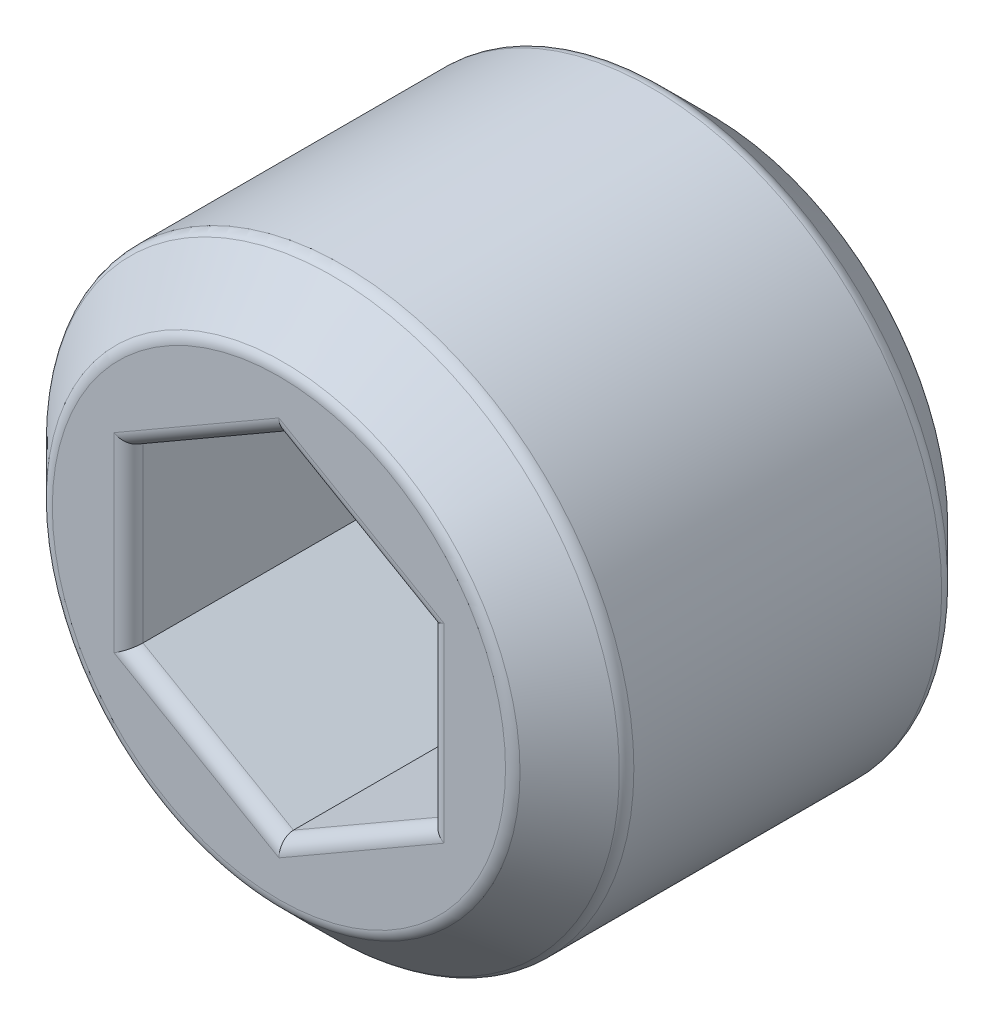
ISO-10303-21;
HEADER;
FILE_DESCRIPTION(('STEP AP214'),'2;1');
FILE_NAME('part.step','',(''),(''),'','','');
FILE_SCHEMA(('AUTOMOTIVE_DESIGN { 1 0 10303 214 1 1 1 1 }'));
ENDSEC;
DATA;
#1=APPLICATION_CONTEXT('core data for automotive mechanical design processes');
#2=APPLICATION_PROTOCOL_DEFINITION('international standard','automotive_design',2000,#1);
#3=PRODUCT_CONTEXT('',#1,'mechanical');
#4=PRODUCT('Part','Part','',(#3));
#5=PRODUCT_RELATED_PRODUCT_CATEGORY('part','',(#4));
#6=PRODUCT_DEFINITION_FORMATION('','',#4);
#7=PRODUCT_DEFINITION_CONTEXT('part definition',#1,'design');
#8=PRODUCT_DEFINITION('design','',#6,#7);
#9=PRODUCT_DEFINITION_SHAPE('','',#8);
#10=(LENGTH_UNIT() NAMED_UNIT(*) SI_UNIT(.MILLI.,.METRE.));
#11=(NAMED_UNIT(*) PLANE_ANGLE_UNIT() SI_UNIT($,.RADIAN.));
#12=(NAMED_UNIT(*) SI_UNIT($,.STERADIAN.) SOLID_ANGLE_UNIT());
#13=UNCERTAINTY_MEASURE_WITH_UNIT(LENGTH_MEASURE(1.E-05),#10,'distance_accuracy_value','');
#14=(GEOMETRIC_REPRESENTATION_CONTEXT(3) GLOBAL_UNCERTAINTY_ASSIGNED_CONTEXT((#13)) GLOBAL_UNIT_ASSIGNED_CONTEXT((#10,
#11,#12)) REPRESENTATION_CONTEXT('',''));
#15=CARTESIAN_POINT('',(0.,0.,0.));
#16=DIRECTION('',(0.,0.,1.));
#17=DIRECTION('',(1.,0.,0.));
#18=AXIS2_PLACEMENT_3D('',#15,#16,#17);
#19=CARTESIAN_POINT('',(0.,0.,3.));
#20=DIRECTION('',(0.,0.,-1.));
#21=DIRECTION('',(-1.,0.,0.));
#22=AXIS2_PLACEMENT_3D('',#19,#20,#21);
#23=CYLINDRICAL_SURFACE('',#22,2.);
#24=CARTESIAN_POINT('',(0.,0.,2.55857864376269));
#25=DIRECTION('',(0.,0.,1.));
#26=DIRECTION('',(1.,0.,0.));
#27=AXIS2_PLACEMENT_3D('',#24,#25,#26);
#28=CIRCLE('',#27,2.);
#29=CARTESIAN_POINT('',(2.,0.,2.55857864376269));
#30=VERTEX_POINT('',#29);
#31=EDGE_CURVE('E11',#30,#30,#28,.F.);
#32=ORIENTED_EDGE('',*,*,#31,.T.);
#33=EDGE_LOOP('',(#32));
#34=FACE_BOUND('',#33,.T.);
#35=CARTESIAN_POINT('',(0.,0.,0.44142135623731));
#36=DIRECTION('',(0.,0.,-1.));
#37=DIRECTION('',(-1.,0.,0.));
#38=AXIS2_PLACEMENT_3D('',#35,#36,#37);
#39=CIRCLE('',#38,2.);
#40=CARTESIAN_POINT('',(-2.,0.,0.44142135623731));
#41=VERTEX_POINT('',#40);
#42=EDGE_CURVE('E42',#41,#41,#39,.F.);
#43=ORIENTED_EDGE('',*,*,#42,.T.);
#44=EDGE_LOOP('',(#43));
#45=FACE_BOUND('',#44,.T.);
#46=ADVANCED_FACE('F35',(#34,#45),#23,.T.);
#47=CARTESIAN_POINT('',(0.,0.,3.));
#48=DIRECTION('',(0.,0.,1.));
#49=DIRECTION('',(1.,0.,0.));
#50=AXIS2_PLACEMENT_3D('',#47,#48,#49);
#51=PLANE('',#50);
#52=CARTESIAN_POINT('',(0.,0.,3.));
#53=DIRECTION('',(0.,0.,1.));
#54=DIRECTION('',(1.,0.,0.));
#55=AXIS2_PLACEMENT_3D('',#52,#53,#54);
#56=CIRCLE('',#55,1.55857864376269);
#57=CARTESIAN_POINT('',(1.55857864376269,0.,3.));
#58=VERTEX_POINT('',#57);
#59=EDGE_CURVE('E178',#58,#58,#56,.T.);
#60=ORIENTED_EDGE('',*,*,#59,.T.);
#61=EDGE_LOOP('',(#60));
#62=FACE_BOUND('',#61,.T.);
#63=DIRECTION('',(0.,-1.,0.));
#64=VECTOR('',#63,1.);
#65=CARTESIAN_POINT('',(-1.13481522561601,0.597450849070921,3.));
#66=LINE('',#65,#64);
#67=CARTESIAN_POINT('',(-1.134815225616,-0.655185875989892,3.));
#68=VERTEX_POINT('',#67);
#69=CARTESIAN_POINT('',(-1.13481522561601,0.655185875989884,3.));
#70=VERTEX_POINT('',#69);
#71=EDGE_CURVE('E173',#68,#70,#66,.F.);
#72=ORIENTED_EDGE('',*,*,#71,.T.);
#73=DIRECTION('',(-0.866025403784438,-0.500000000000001,0.));
#74=VECTOR('',#73,1.);
#75=CARTESIAN_POINT('',(-0.0500000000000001,1.28150423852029,3.));
#76=LINE('',#75,#74);
#77=CARTESIAN_POINT('',(0.,1.31037175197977,3.));
#78=VERTEX_POINT('',#77);
#79=EDGE_CURVE('E175',#70,#78,#76,.F.);
#80=ORIENTED_EDGE('',*,*,#79,.T.);
#81=DIRECTION('',(-0.866025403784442,0.499999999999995,0.));
#82=VECTOR('',#81,1.);
#83=CARTESIAN_POINT('',(1.084815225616,0.68405338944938,3.));
#84=LINE('',#83,#82);
#85=CARTESIAN_POINT('',(1.134815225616,0.655185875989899,3.));
#86=VERTEX_POINT('',#85);
#87=EDGE_CURVE('E165',#78,#86,#84,.F.);
#88=ORIENTED_EDGE('',*,*,#87,.T.);
#89=DIRECTION('',(0.,1.,0.));
#90=VECTOR('',#89,1.);
#91=CARTESIAN_POINT('',(1.13481522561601,-0.597450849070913,3.));
#92=LINE('',#91,#90);
#93=CARTESIAN_POINT('',(1.13481522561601,-0.655185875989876,3.));
#94=VERTEX_POINT('',#93);
#95=EDGE_CURVE('E167',#86,#94,#92,.F.);
#96=ORIENTED_EDGE('',*,*,#95,.T.);
#97=DIRECTION('',(0.866025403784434,0.500000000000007,0.));
#98=VECTOR('',#97,1.);
#99=CARTESIAN_POINT('',(0.0500000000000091,-1.28150423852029,3.));
#100=LINE('',#99,#98);
#101=CARTESIAN_POINT('',(0.,-1.31037175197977,3.));
#102=VERTEX_POINT('',#101);
#103=EDGE_CURVE('E169',#94,#102,#100,.F.);
#104=ORIENTED_EDGE('',*,*,#103,.T.);
#105=DIRECTION('',(0.866025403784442,-0.499999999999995,0.));
#106=VECTOR('',#105,1.);
#107=CARTESIAN_POINT('',(-1.084815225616,-0.684053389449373,3.));
#108=LINE('',#107,#106);
#109=EDGE_CURVE('E171',#102,#68,#108,.F.);
#110=ORIENTED_EDGE('',*,*,#109,.T.);
#111=EDGE_LOOP('',(#72,#80,#88,#96,#104,#110));
#112=FACE_BOUND('',#111,.T.);
#113=ADVANCED_FACE('F212',(#62,#112),#51,.T.);
#114=CARTESIAN_POINT('',(0.,0.,0.));
#115=DIRECTION('',(0.,0.,1.));
#116=DIRECTION('',(1.,0.,0.));
#117=AXIS2_PLACEMENT_3D('',#114,#115,#116);
#118=PLANE('',#117);
#119=CARTESIAN_POINT('',(0.,0.,0.));
#120=DIRECTION('',(0.,0.,1.));
#121=DIRECTION('',(1.,0.,0.));
#122=AXIS2_PLACEMENT_3D('',#119,#120,#121);
#123=CIRCLE('',#122,1.55857864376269);
#124=CARTESIAN_POINT('',(1.55857864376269,0.,0.));
#125=VERTEX_POINT('',#124);
#126=EDGE_CURVE('E148',#125,#125,#123,.F.);
#127=ORIENTED_EDGE('',*,*,#126,.T.);
#128=EDGE_LOOP('',(#127));
#129=FACE_BOUND('',#128,.T.);
#130=ADVANCED_FACE('F217',(#129),#118,.F.);
#131=CARTESIAN_POINT('',(0.,0.,0.4));
#132=DIRECTION('',(0.,0.,1.));
#133=DIRECTION('',(1.,0.,0.));
#134=AXIS2_PLACEMENT_3D('',#131,#132,#133);
#135=CONICAL_SURFACE('',#134,2.,0.78539816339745);
#136=CARTESIAN_POINT('',(0.,0.,0.029289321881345));
#137=DIRECTION('',(0.,0.,1.));
#138=DIRECTION('',(1.,0.,0.));
#139=AXIS2_PLACEMENT_3D('',#136,#137,#138);
#140=CIRCLE('',#139,1.62928932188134);
#141=CARTESIAN_POINT('',(1.62928932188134,0.,0.029289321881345));
#142=VERTEX_POINT('',#141);
#143=EDGE_CURVE('E162',#142,#142,#140,.T.);
#144=ORIENTED_EDGE('',*,*,#143,.T.);
#145=EDGE_LOOP('',(#144));
#146=FACE_BOUND('',#145,.T.);
#147=CARTESIAN_POINT('',(0.,0.,0.370710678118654));
#148=DIRECTION('',(0.,0.,1.));
#149=DIRECTION('',(1.,0.,0.));
#150=AXIS2_PLACEMENT_3D('',#147,#148,#149);
#151=CIRCLE('',#150,1.97071067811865);
#152=CARTESIAN_POINT('',(1.97071067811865,0.,0.370710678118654));
#153=VERTEX_POINT('',#152);
#154=EDGE_CURVE('E159',#153,#153,#151,.F.);
#155=ORIENTED_EDGE('',*,*,#154,.T.);
#156=EDGE_LOOP('',(#155));
#157=FACE_BOUND('',#156,.T.);
#158=ADVANCED_FACE('F224',(#146,#157),#135,.T.);
#159=CARTESIAN_POINT('',(0.,0.,3.));
#160=DIRECTION('',(0.,0.,-1.));
#161=DIRECTION('',(-1.,0.,0.));
#162=AXIS2_PLACEMENT_3D('',#159,#160,#161);
#163=CONICAL_SURFACE('',#162,1.6,0.785398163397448);
#164=CARTESIAN_POINT('',(0.,0.,2.97071067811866));
#165=DIRECTION('',(0.,0.,1.));
#166=DIRECTION('',(1.,0.,0.));
#167=AXIS2_PLACEMENT_3D('',#164,#165,#166);
#168=CIRCLE('',#167,1.62928932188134);
#169=CARTESIAN_POINT('',(1.62928932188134,0.,2.97071067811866));
#170=VERTEX_POINT('',#169);
#171=EDGE_CURVE('E184',#170,#170,#168,.F.);
#172=ORIENTED_EDGE('',*,*,#171,.T.);
#173=EDGE_LOOP('',(#172));
#174=FACE_BOUND('',#173,.T.);
#175=CARTESIAN_POINT('',(0.,0.,2.62928932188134));
#176=DIRECTION('',(0.,0.,-1.));
#177=DIRECTION('',(-1.,0.,0.));
#178=AXIS2_PLACEMENT_3D('',#175,#176,#177);
#179=CIRCLE('',#178,1.97071067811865);
#180=CARTESIAN_POINT('',(-1.97071067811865,0.,2.62928932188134));
#181=VERTEX_POINT('',#180);
#182=EDGE_CURVE('E181',#181,#181,#179,.F.);
#183=ORIENTED_EDGE('',*,*,#182,.T.);
#184=EDGE_LOOP('',(#183));
#185=FACE_BOUND('',#184,.T.);
#186=ADVANCED_FACE('F231',(#174,#185),#163,.T.);
#187=CARTESIAN_POINT('',(1.034815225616,0.597450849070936,1.));
#188=DIRECTION('',(0.499999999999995,0.866025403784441,0.));
#189=DIRECTION('',(-0.866025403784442,0.499999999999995,0.));
#190=AXIS2_PLACEMENT_3D('',#187,#188,#189);
#191=PLANE('',#190);
#192=DIRECTION('',(0.,0.,1.));
#193=VECTOR('',#192,1.);
#194=CARTESIAN_POINT('',(1.034815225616,0.597450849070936,1.));
#195=LINE('',#194,#193);
#196=CARTESIAN_POINT('',(1.034815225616,0.597450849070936,1.));
#197=VERTEX_POINT('',#196);
#198=CARTESIAN_POINT('',(1.034815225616,0.597450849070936,2.9));
#199=VERTEX_POINT('',#198);
#200=EDGE_CURVE('E146',#197,#199,#195,.T.);
#201=ORIENTED_EDGE('',*,*,#200,.T.);
#202=DIRECTION('',(-0.866025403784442,0.499999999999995,0.));
#203=VECTOR('',#202,1.);
#204=CARTESIAN_POINT('',(0.,1.19490169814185,2.9));
#205=LINE('',#204,#203);
#206=CARTESIAN_POINT('',(0.,1.19490169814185,2.9));
#207=VERTEX_POINT('',#206);
#208=EDGE_CURVE('E113',#199,#207,#205,.T.);
#209=ORIENTED_EDGE('',*,*,#208,.T.);
#210=DIRECTION('',(0.,0.,1.));
#211=VECTOR('',#210,1.);
#212=CARTESIAN_POINT('',(0.,1.19490169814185,1.));
#213=LINE('',#212,#211);
#214=CARTESIAN_POINT('',(0.,1.19490169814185,1.));
#215=VERTEX_POINT('',#214);
#216=EDGE_CURVE('E106',#215,#207,#213,.T.);
#217=ORIENTED_EDGE('',*,*,#216,.F.);
#218=DIRECTION('',(-0.866025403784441,0.499999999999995,0.));
#219=VECTOR('',#218,1.);
#220=CARTESIAN_POINT('',(1.034815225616,0.597450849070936,1.));
#221=LINE('',#220,#219);
#222=EDGE_CURVE('E110',#197,#215,#221,.T.);
#223=ORIENTED_EDGE('',*,*,#222,.F.);
#224=EDGE_LOOP('',(#201,#209,#217,#223));
#225=FACE_BOUND('',#224,.T.);
#226=ADVANCED_FACE('F108',(#225),#191,.F.);
#227=CARTESIAN_POINT('',(1.03481522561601,-0.597450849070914,1.));
#228=DIRECTION('',(1.,0.,0.));
#229=DIRECTION('',(0.,1.,0.));
#230=AXIS2_PLACEMENT_3D('',#227,#228,#229);
#231=PLANE('',#230);
#232=DIRECTION('',(0.,0.,1.));
#233=VECTOR('',#232,1.);
#234=CARTESIAN_POINT('',(1.03481522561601,-0.597450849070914,1.));
#235=LINE('',#234,#233);
#236=CARTESIAN_POINT('',(1.03481522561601,-0.597450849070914,1.));
#237=VERTEX_POINT('',#236);
#238=CARTESIAN_POINT('',(1.03481522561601,-0.597450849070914,2.9));
#239=VERTEX_POINT('',#238);
#240=EDGE_CURVE('E149',#237,#239,#235,.T.);
#241=ORIENTED_EDGE('',*,*,#240,.T.);
#242=DIRECTION('',(0.,1.,0.));
#243=VECTOR('',#242,1.);
#244=CARTESIAN_POINT('',(1.034815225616,0.597450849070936,2.9));
#245=LINE('',#244,#243);
#246=EDGE_CURVE('E49',#239,#199,#245,.T.);
#247=ORIENTED_EDGE('',*,*,#246,.T.);
#248=ORIENTED_EDGE('',*,*,#200,.F.);
#249=DIRECTION('',(0.,1.,0.));
#250=VECTOR('',#249,1.);
#251=CARTESIAN_POINT('',(1.03481522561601,-0.597450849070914,1.));
#252=LINE('',#251,#250);
#253=EDGE_CURVE('E118',#237,#197,#252,.T.);
#254=ORIENTED_EDGE('',*,*,#253,.F.);
#255=EDGE_LOOP('',(#241,#247,#248,#254));
#256=FACE_BOUND('',#255,.T.);
#257=ADVANCED_FACE('F238',(#256),#231,.F.);
#258=CARTESIAN_POINT('',(0.,-1.19490169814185,1.));
#259=DIRECTION('',(0.500000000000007,-0.866025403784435,0.));
#260=DIRECTION('',(0.866025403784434,0.500000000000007,0.));
#261=AXIS2_PLACEMENT_3D('',#258,#259,#260);
#262=PLANE('',#261);
#263=DIRECTION('',(0.,0.,1.));
#264=VECTOR('',#263,1.);
#265=CARTESIAN_POINT('',(0.,-1.19490169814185,1.));
#266=LINE('',#265,#264);
#267=CARTESIAN_POINT('',(0.,-1.19490169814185,1.));
#268=VERTEX_POINT('',#267);
#269=CARTESIAN_POINT('',(0.,-1.19490169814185,2.9));
#270=VERTEX_POINT('',#269);
#271=EDGE_CURVE('E151',#268,#270,#266,.T.);
#272=ORIENTED_EDGE('',*,*,#271,.T.);
#273=DIRECTION('',(0.866025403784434,0.500000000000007,0.));
#274=VECTOR('',#273,1.);
#275=CARTESIAN_POINT('',(1.03481522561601,-0.597450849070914,2.9));
#276=LINE('',#275,#274);
#277=EDGE_CURVE('E57',#270,#239,#276,.T.);
#278=ORIENTED_EDGE('',*,*,#277,.T.);
#279=ORIENTED_EDGE('',*,*,#240,.F.);
#280=DIRECTION('',(0.866025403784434,0.500000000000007,0.));
#281=VECTOR('',#280,1.);
#282=CARTESIAN_POINT('',(0.,-1.19490169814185,1.));
#283=LINE('',#282,#281);
#284=EDGE_CURVE('E143',#268,#237,#283,.T.);
#285=ORIENTED_EDGE('',*,*,#284,.F.);
#286=EDGE_LOOP('',(#272,#278,#279,#285));
#287=FACE_BOUND('',#286,.T.);
#288=ADVANCED_FACE('F248',(#287),#262,.F.);
#289=CARTESIAN_POINT('',(-1.034815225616,-0.597450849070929,1.));
#290=DIRECTION('',(-0.499999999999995,-0.866025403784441,0.));
#291=DIRECTION('',(0.866025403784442,-0.499999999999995,0.));
#292=AXIS2_PLACEMENT_3D('',#289,#290,#291);
#293=PLANE('',#292);
#294=DIRECTION('',(0.,0.,1.));
#295=VECTOR('',#294,1.);
#296=CARTESIAN_POINT('',(-1.034815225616,-0.597450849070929,1.));
#297=LINE('',#296,#295);
#298=CARTESIAN_POINT('',(-1.034815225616,-0.597450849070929,1.));
#299=VERTEX_POINT('',#298);
#300=CARTESIAN_POINT('',(-1.034815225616,-0.597450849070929,2.9));
#301=VERTEX_POINT('',#300);
#302=EDGE_CURVE('E153',#299,#301,#297,.T.);
#303=ORIENTED_EDGE('',*,*,#302,.T.);
#304=DIRECTION('',(0.866025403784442,-0.499999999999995,0.));
#305=VECTOR('',#304,1.);
#306=CARTESIAN_POINT('',(0.,-1.19490169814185,2.9));
#307=LINE('',#306,#305);
#308=EDGE_CURVE('E191',#301,#270,#307,.T.);
#309=ORIENTED_EDGE('',*,*,#308,.T.);
#310=ORIENTED_EDGE('',*,*,#271,.F.);
#311=DIRECTION('',(0.866025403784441,-0.499999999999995,0.));
#312=VECTOR('',#311,1.);
#313=CARTESIAN_POINT('',(-1.034815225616,-0.597450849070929,1.));
#314=LINE('',#313,#312);
#315=EDGE_CURVE('E140',#299,#268,#314,.T.);
#316=ORIENTED_EDGE('',*,*,#315,.F.);
#317=EDGE_LOOP('',(#303,#309,#310,#316));
#318=FACE_BOUND('',#317,.T.);
#319=ADVANCED_FACE('F244',(#318),#293,.F.);
#320=CARTESIAN_POINT('',(-1.03481522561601,0.597450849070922,1.));
#321=DIRECTION('',(-1.,0.,0.));
#322=DIRECTION('',(0.,-1.,0.));
#323=AXIS2_PLACEMENT_3D('',#320,#321,#322);
#324=PLANE('',#323);
#325=DIRECTION('',(0.,0.,1.));
#326=VECTOR('',#325,1.);
#327=CARTESIAN_POINT('',(-1.03481522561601,0.597450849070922,1.));
#328=LINE('',#327,#326);
#329=CARTESIAN_POINT('',(-1.03481522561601,0.597450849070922,1.));
#330=VERTEX_POINT('',#329);
#331=CARTESIAN_POINT('',(-1.03481522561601,0.597450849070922,2.9));
#332=VERTEX_POINT('',#331);
#333=EDGE_CURVE('E117',#330,#332,#328,.T.);
#334=ORIENTED_EDGE('',*,*,#333,.T.);
#335=DIRECTION('',(0.,-1.,0.));
#336=VECTOR('',#335,1.);
#337=CARTESIAN_POINT('',(-1.034815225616,-0.597450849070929,2.9));
#338=LINE('',#337,#336);
#339=EDGE_CURVE('E189',#332,#301,#338,.T.);
#340=ORIENTED_EDGE('',*,*,#339,.T.);
#341=ORIENTED_EDGE('',*,*,#302,.F.);
#342=DIRECTION('',(0.,-1.,0.));
#343=VECTOR('',#342,1.);
#344=CARTESIAN_POINT('',(-1.03481522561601,0.597450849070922,1.));
#345=LINE('',#344,#343);
#346=EDGE_CURVE('E127',#330,#299,#345,.T.);
#347=ORIENTED_EDGE('',*,*,#346,.F.);
#348=EDGE_LOOP('',(#334,#340,#341,#347));
#349=FACE_BOUND('',#348,.T.);
#350=ADVANCED_FACE('F241',(#349),#324,.F.);
#351=CARTESIAN_POINT('',(0.,1.19490169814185,1.));
#352=DIRECTION('',(-0.500000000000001,0.866025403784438,0.));
#353=DIRECTION('',(-0.866025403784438,-0.500000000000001,0.));
#354=AXIS2_PLACEMENT_3D('',#351,#352,#353);
#355=PLANE('',#354);
#356=ORIENTED_EDGE('',*,*,#216,.T.);
#357=DIRECTION('',(-0.866025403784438,-0.500000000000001,0.));
#358=VECTOR('',#357,1.);
#359=CARTESIAN_POINT('',(-1.03481522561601,0.597450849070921,2.9));
#360=LINE('',#359,#358);
#361=EDGE_CURVE('E187',#207,#332,#360,.T.);
#362=ORIENTED_EDGE('',*,*,#361,.T.);
#363=ORIENTED_EDGE('',*,*,#333,.F.);
#364=DIRECTION('',(-0.866025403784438,-0.500000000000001,0.));
#365=VECTOR('',#364,1.);
#366=CARTESIAN_POINT('',(0.,1.19490169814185,1.));
#367=LINE('',#366,#365);
#368=EDGE_CURVE('E121',#215,#330,#367,.T.);
#369=ORIENTED_EDGE('',*,*,#368,.F.);
#370=EDGE_LOOP('',(#356,#362,#363,#369));
#371=FACE_BOUND('',#370,.T.);
#372=ADVANCED_FACE('F122',(#371),#355,.F.);
#373=CARTESIAN_POINT('',(2.06963045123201,0.,1.));
#374=DIRECTION('',(0.,0.,-1.));
#375=DIRECTION('',(-1.,0.,0.));
#376=AXIS2_PLACEMENT_3D('',#373,#374,#375);
#377=PLANE('',#376);
#378=ORIENTED_EDGE('',*,*,#222,.T.);
#379=ORIENTED_EDGE('',*,*,#368,.T.);
#380=ORIENTED_EDGE('',*,*,#346,.T.);
#381=ORIENTED_EDGE('',*,*,#315,.T.);
#382=ORIENTED_EDGE('',*,*,#284,.T.);
#383=ORIENTED_EDGE('',*,*,#253,.T.);
#384=EDGE_LOOP('',(#378,#379,#380,#381,#382,#383));
#385=FACE_BOUND('',#384,.T.);
#386=ADVANCED_FACE('F129',(#385),#377,.F.);
#387=CARTESIAN_POINT('',(0.,0.,0.1));
#388=DIRECTION('',(0.,0.,1.));
#389=DIRECTION('',(1.,0.,0.));
#390=AXIS2_PLACEMENT_3D('',#387,#388,#389);
#391=TOROIDAL_SURFACE('',#390,1.55857864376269,0.1);
#392=ORIENTED_EDGE('',*,*,#143,.F.);
#393=EDGE_LOOP('',(#392));
#394=FACE_BOUND('',#393,.T.);
#395=ORIENTED_EDGE('',*,*,#126,.F.);
#396=EDGE_LOOP('',(#395));
#397=FACE_BOUND('',#396,.T.);
#398=ADVANCED_FACE('F256',(#394,#397),#391,.T.);
#399=CARTESIAN_POINT('',(0.,0.,2.9));
#400=DIRECTION('',(0.,0.,1.));
#401=DIRECTION('',(1.,0.,0.));
#402=AXIS2_PLACEMENT_3D('',#399,#400,#401);
#403=TOROIDAL_SURFACE('',#402,1.55857864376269,0.1);
#404=ORIENTED_EDGE('',*,*,#171,.F.);
#405=EDGE_LOOP('',(#404));
#406=FACE_BOUND('',#405,.T.);
#407=ORIENTED_EDGE('',*,*,#59,.F.);
#408=EDGE_LOOP('',(#407));
#409=FACE_BOUND('',#408,.T.);
#410=ADVANCED_FACE('F259',(#406,#409),#403,.T.);
#411=CARTESIAN_POINT('',(0.0500000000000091,-1.28150423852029,2.9));
#412=DIRECTION('',(-0.866025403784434,-0.500000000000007,0.));
#413=DIRECTION('',(0.500000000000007,-0.866025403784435,0.));
#414=AXIS2_PLACEMENT_3D('',#411,#412,#413);
#415=CYLINDRICAL_SURFACE('',#414,0.1);
#416=CARTESIAN_POINT('',(0.,-1.31037175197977,2.9));
#417=DIRECTION('',(-1.,0.,0.));
#418=DIRECTION('',(0.,1.,0.));
#419=AXIS2_PLACEMENT_3D('',#416,#417,#418);
#420=ELLIPSE('',#419,0.115470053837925,0.1);
#421=EDGE_CURVE('E135',#102,#270,#420,.T.);
#422=ORIENTED_EDGE('',*,*,#421,.F.);
#423=ORIENTED_EDGE('',*,*,#103,.F.);
#424=CARTESIAN_POINT('',(1.13481522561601,-0.655185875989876,2.9));
#425=DIRECTION('',(-0.499999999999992,-0.866025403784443,0.));
#426=DIRECTION('',(-0.866025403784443,0.499999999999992,0.));
#427=AXIS2_PLACEMENT_3D('',#424,#425,#426);
#428=ELLIPSE('',#427,0.115470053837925,0.1);
#429=EDGE_CURVE('E132',#239,#94,#428,.F.);
#430=ORIENTED_EDGE('',*,*,#429,.F.);
#431=ORIENTED_EDGE('',*,*,#277,.F.);
#432=EDGE_LOOP('',(#422,#423,#430,#431));
#433=FACE_BOUND('',#432,.T.);
#434=ADVANCED_FACE('F263',(#433),#415,.T.);
#435=CARTESIAN_POINT('',(1.13481522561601,-0.597450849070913,2.9));
#436=DIRECTION('',(0.,-1.,0.));
#437=DIRECTION('',(1.,0.,0.));
#438=AXIS2_PLACEMENT_3D('',#435,#436,#437);
#439=CYLINDRICAL_SURFACE('',#438,0.1);
#440=ORIENTED_EDGE('',*,*,#429,.T.);
#441=ORIENTED_EDGE('',*,*,#95,.F.);
#442=CARTESIAN_POINT('',(1.134815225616,0.655185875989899,2.9));
#443=DIRECTION('',(0.500000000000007,-0.866025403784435,0.));
#444=DIRECTION('',(-0.866025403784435,-0.500000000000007,0.));
#445=AXIS2_PLACEMENT_3D('',#442,#443,#444);
#446=ELLIPSE('',#445,0.115470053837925,0.1);
#447=EDGE_CURVE('E298',#199,#86,#446,.F.);
#448=ORIENTED_EDGE('',*,*,#447,.F.);
#449=ORIENTED_EDGE('',*,*,#246,.F.);
#450=EDGE_LOOP('',(#440,#441,#448,#449));
#451=FACE_BOUND('',#450,.T.);
#452=ADVANCED_FACE('F267',(#451),#439,.T.);
#453=CARTESIAN_POINT('',(-1.084815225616,-0.684053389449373,2.9));
#454=DIRECTION('',(-0.866025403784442,0.499999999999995,0.));
#455=DIRECTION('',(-0.499999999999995,-0.866025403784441,0.));
#456=AXIS2_PLACEMENT_3D('',#453,#454,#455);
#457=CYLINDRICAL_SURFACE('',#456,0.1);
#458=ORIENTED_EDGE('',*,*,#421,.T.);
#459=ORIENTED_EDGE('',*,*,#308,.F.);
#460=CARTESIAN_POINT('',(-1.134815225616,-0.655185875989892,2.9));
#461=DIRECTION('',(-0.500000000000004,0.866025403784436,0.));
#462=DIRECTION('',(0.866025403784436,0.500000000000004,0.));
#463=AXIS2_PLACEMENT_3D('',#460,#461,#462);
#464=ELLIPSE('',#463,0.115470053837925,0.1);
#465=EDGE_CURVE('E293',#68,#301,#464,.T.);
#466=ORIENTED_EDGE('',*,*,#465,.F.);
#467=ORIENTED_EDGE('',*,*,#109,.F.);
#468=EDGE_LOOP('',(#458,#459,#466,#467));
#469=FACE_BOUND('',#468,.T.);
#470=ADVANCED_FACE('F271',(#469),#457,.T.);
#471=CARTESIAN_POINT('',(1.084815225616,0.68405338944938,2.9));
#472=DIRECTION('',(0.866025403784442,-0.499999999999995,0.));
#473=DIRECTION('',(0.499999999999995,0.866025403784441,0.));
#474=AXIS2_PLACEMENT_3D('',#471,#472,#473);
#475=CYLINDRICAL_SURFACE('',#474,0.1);
#476=ORIENTED_EDGE('',*,*,#447,.T.);
#477=ORIENTED_EDGE('',*,*,#87,.F.);
#478=CARTESIAN_POINT('',(0.,1.31037175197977,2.9));
#479=DIRECTION('',(1.,0.,0.));
#480=DIRECTION('',(0.,1.,0.));
#481=AXIS2_PLACEMENT_3D('',#478,#479,#480);
#482=ELLIPSE('',#481,0.115470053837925,0.1);
#483=EDGE_CURVE('E290',#207,#78,#482,.F.);
#484=ORIENTED_EDGE('',*,*,#483,.F.);
#485=ORIENTED_EDGE('',*,*,#208,.F.);
#486=EDGE_LOOP('',(#476,#477,#484,#485));
#487=FACE_BOUND('',#486,.T.);
#488=ADVANCED_FACE('F275',(#487),#475,.T.);
#489=CARTESIAN_POINT('',(-1.13481522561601,0.597450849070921,2.9));
#490=DIRECTION('',(0.,1.,0.));
#491=DIRECTION('',(-1.,0.,0.));
#492=AXIS2_PLACEMENT_3D('',#489,#490,#491);
#493=CYLINDRICAL_SURFACE('',#492,0.1);
#494=ORIENTED_EDGE('',*,*,#465,.T.);
#495=ORIENTED_EDGE('',*,*,#339,.F.);
#496=CARTESIAN_POINT('',(-1.13481522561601,0.655185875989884,2.9));
#497=DIRECTION('',(0.499999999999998,0.86602540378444,0.));
#498=DIRECTION('',(0.86602540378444,-0.499999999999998,0.));
#499=AXIS2_PLACEMENT_3D('',#496,#497,#498);
#500=ELLIPSE('',#499,0.115470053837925,0.1);
#501=EDGE_CURVE('E294',#70,#332,#500,.T.);
#502=ORIENTED_EDGE('',*,*,#501,.F.);
#503=ORIENTED_EDGE('',*,*,#71,.F.);
#504=EDGE_LOOP('',(#494,#495,#502,#503));
#505=FACE_BOUND('',#504,.T.);
#506=ADVANCED_FACE('F279',(#505),#493,.T.);
#507=CARTESIAN_POINT('',(-0.0500000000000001,1.28150423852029,2.9));
#508=DIRECTION('',(0.866025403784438,0.500000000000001,0.));
#509=DIRECTION('',(-0.500000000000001,0.866025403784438,0.));
#510=AXIS2_PLACEMENT_3D('',#507,#508,#509);
#511=CYLINDRICAL_SURFACE('',#510,0.1);
#512=ORIENTED_EDGE('',*,*,#483,.T.);
#513=ORIENTED_EDGE('',*,*,#79,.F.);
#514=ORIENTED_EDGE('',*,*,#501,.T.);
#515=ORIENTED_EDGE('',*,*,#361,.F.);
#516=EDGE_LOOP('',(#512,#513,#514,#515));
#517=FACE_BOUND('',#516,.T.);
#518=ADVANCED_FACE('F207',(#517),#511,.T.);
#519=CARTESIAN_POINT('',(0.,0.,2.55857864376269));
#520=DIRECTION('',(0.,0.,1.));
#521=DIRECTION('',(1.,0.,0.));
#522=AXIS2_PLACEMENT_3D('',#519,#520,#521);
#523=TOROIDAL_SURFACE('',#522,1.9,0.1);
#524=ORIENTED_EDGE('',*,*,#182,.F.);
#525=EDGE_LOOP('',(#524));
#526=FACE_BOUND('',#525,.T.);
#527=ORIENTED_EDGE('',*,*,#31,.F.);
#528=EDGE_LOOP('',(#527));
#529=FACE_BOUND('',#528,.T.);
#530=ADVANCED_FACE('F201',(#526,#529),#523,.T.);
#531=CARTESIAN_POINT('',(0.,0.,0.44142135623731));
#532=DIRECTION('',(0.,0.,-1.));
#533=DIRECTION('',(-1.,0.,0.));
#534=AXIS2_PLACEMENT_3D('',#531,#532,#533);
#535=TOROIDAL_SURFACE('',#534,1.9,0.1);
#536=ORIENTED_EDGE('',*,*,#154,.F.);
#537=EDGE_LOOP('',(#536));
#538=FACE_BOUND('',#537,.T.);
#539=ORIENTED_EDGE('',*,*,#42,.F.);
#540=EDGE_LOOP('',(#539));
#541=FACE_BOUND('',#540,.T.);
#542=ADVANCED_FACE('F199',(#538,#541),#535,.T.);
#543=CLOSED_SHELL('',(#46,#113,#130,#158,#186,#226,#257,#288,#319,#350,#372,#386,#398,#410,#434,
#452,#470,#488,#506,#518,#530,#542));
#544=MANIFOLD_SOLID_BREP('B2',#543);
#545=ADVANCED_BREP_SHAPE_REPRESENTATION('',(#18,#544),#14);
#546=SHAPE_DEFINITION_REPRESENTATION(#9,#545);
ENDSEC;
END-ISO-10303-21;
